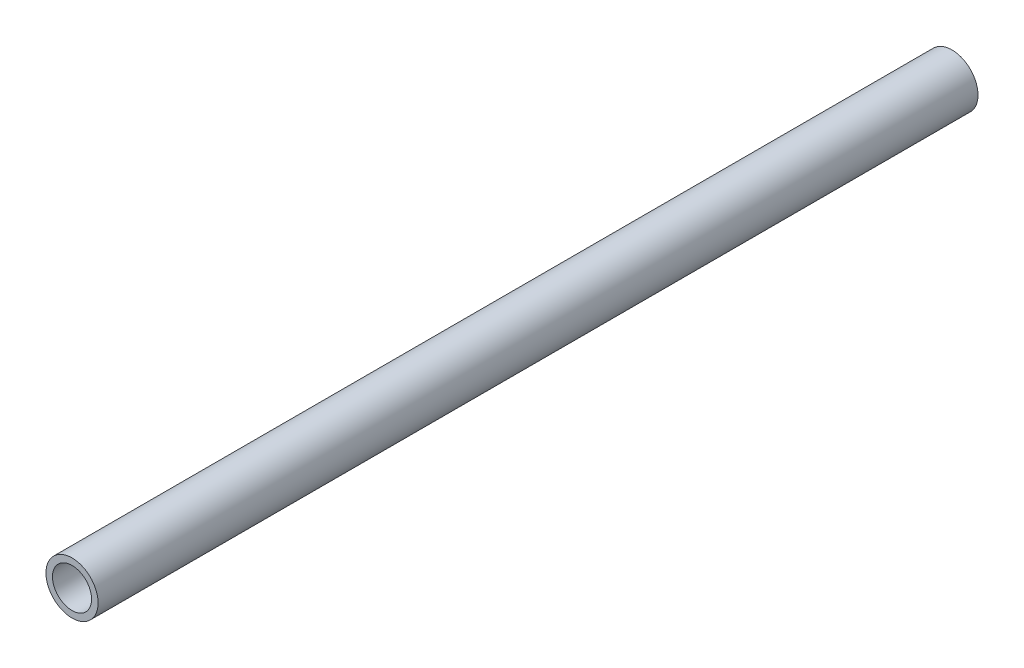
ISO-10303-21;
HEADER;
FILE_DESCRIPTION(('STEP AP214'),'2;1');
FILE_NAME('part.step','',(''),(''),'','','');
FILE_SCHEMA(('AUTOMOTIVE_DESIGN { 1 0 10303 214 1 1 1 1 }'));
ENDSEC;
DATA;
#1=APPLICATION_CONTEXT('core data for automotive mechanical design processes');
#2=APPLICATION_PROTOCOL_DEFINITION('international standard','automotive_design',2000,#1);
#3=PRODUCT_CONTEXT('',#1,'mechanical');
#4=PRODUCT('Part','Part','',(#3));
#5=PRODUCT_RELATED_PRODUCT_CATEGORY('part','',(#4));
#6=PRODUCT_DEFINITION_FORMATION('','',#4);
#7=PRODUCT_DEFINITION_CONTEXT('part definition',#1,'design');
#8=PRODUCT_DEFINITION('design','',#6,#7);
#9=PRODUCT_DEFINITION_SHAPE('','',#8);
#10=(LENGTH_UNIT() NAMED_UNIT(*) SI_UNIT(.MILLI.,.METRE.));
#11=(NAMED_UNIT(*) PLANE_ANGLE_UNIT() SI_UNIT($,.RADIAN.));
#12=(NAMED_UNIT(*) SI_UNIT($,.STERADIAN.) SOLID_ANGLE_UNIT());
#13=UNCERTAINTY_MEASURE_WITH_UNIT(LENGTH_MEASURE(1.E-05),#10,'distance_accuracy_value','');
#14=(GEOMETRIC_REPRESENTATION_CONTEXT(3) GLOBAL_UNCERTAINTY_ASSIGNED_CONTEXT((#13)) GLOBAL_UNIT_ASSIGNED_CONTEXT((#10,
#11,#12)) REPRESENTATION_CONTEXT('',''));
#15=CARTESIAN_POINT('',(0.,0.,0.));
#16=DIRECTION('',(0.,0.,1.));
#17=DIRECTION('',(1.,0.,0.));
#18=AXIS2_PLACEMENT_3D('',#15,#16,#17);
#19=CARTESIAN_POINT('',(0.,0.,-135.));
#20=DIRECTION('',(0.,0.,1.));
#21=DIRECTION('',(1.,0.,0.));
#22=AXIS2_PLACEMENT_3D('',#19,#20,#21);
#23=CYLINDRICAL_SURFACE('',#22,4.);
#24=CARTESIAN_POINT('',(0.,0.,-135.));
#25=DIRECTION('',(0.,0.,1.));
#26=DIRECTION('',(1.,0.,0.));
#27=AXIS2_PLACEMENT_3D('',#24,#25,#26);
#28=CIRCLE('',#27,4.);
#29=CARTESIAN_POINT('',(4.,0.,-135.));
#30=VERTEX_POINT('',#29);
#31=EDGE_CURVE('E10',#30,#30,#28,.T.);
#32=ORIENTED_EDGE('',*,*,#31,.T.);
#33=EDGE_LOOP('',(#32));
#34=FACE_BOUND('',#33,.T.);
#35=CARTESIAN_POINT('',(0.,0.,0.));
#36=DIRECTION('',(0.,0.,1.));
#37=DIRECTION('',(1.,0.,0.));
#38=AXIS2_PLACEMENT_3D('',#35,#36,#37);
#39=CIRCLE('',#38,4.);
#40=CARTESIAN_POINT('',(4.,0.,0.));
#41=VERTEX_POINT('',#40);
#42=EDGE_CURVE('E34',#41,#41,#39,.T.);
#43=ORIENTED_EDGE('',*,*,#42,.F.);
#44=EDGE_LOOP('',(#43));
#45=FACE_BOUND('',#44,.T.);
#46=ADVANCED_FACE('F28',(#34,#45),#23,.T.);
#47=CARTESIAN_POINT('',(0.,0.,-135.));
#48=DIRECTION('',(0.,0.,1.));
#49=DIRECTION('',(1.,0.,0.));
#50=AXIS2_PLACEMENT_3D('',#47,#48,#49);
#51=PLANE('',#50);
#52=CARTESIAN_POINT('',(0.,0.,-135.));
#53=DIRECTION('',(0.,0.,1.));
#54=DIRECTION('',(1.,0.,0.));
#55=AXIS2_PLACEMENT_3D('',#52,#53,#54);
#56=CIRCLE('',#55,3.);
#57=CARTESIAN_POINT('',(3.,0.,-135.));
#58=VERTEX_POINT('',#57);
#59=EDGE_CURVE('E38',#58,#58,#56,.T.);
#60=ORIENTED_EDGE('',*,*,#59,.T.);
#61=EDGE_LOOP('',(#60));
#62=FACE_BOUND('',#61,.T.);
#63=ORIENTED_EDGE('',*,*,#31,.F.);
#64=EDGE_LOOP('',(#63));
#65=FACE_BOUND('',#64,.T.);
#66=ADVANCED_FACE('F52',(#62,#65),#51,.F.);
#67=CARTESIAN_POINT('',(0.,0.,0.));
#68=DIRECTION('',(0.,0.,1.));
#69=DIRECTION('',(1.,0.,0.));
#70=AXIS2_PLACEMENT_3D('',#67,#68,#69);
#71=PLANE('',#70);
#72=CARTESIAN_POINT('',(0.,0.,0.));
#73=DIRECTION('',(0.,0.,1.));
#74=DIRECTION('',(1.,0.,0.));
#75=AXIS2_PLACEMENT_3D('',#72,#73,#74);
#76=CIRCLE('',#75,3.);
#77=CARTESIAN_POINT('',(3.,0.,0.));
#78=VERTEX_POINT('',#77);
#79=EDGE_CURVE('E42',#78,#78,#76,.T.);
#80=ORIENTED_EDGE('',*,*,#79,.F.);
#81=EDGE_LOOP('',(#80));
#82=FACE_BOUND('',#81,.T.);
#83=ORIENTED_EDGE('',*,*,#42,.T.);
#84=EDGE_LOOP('',(#83));
#85=FACE_BOUND('',#84,.T.);
#86=ADVANCED_FACE('F50',(#82,#85),#71,.T.);
#87=CARTESIAN_POINT('',(0.,0.,-135.));
#88=DIRECTION('',(0.,0.,1.));
#89=DIRECTION('',(1.,0.,0.));
#90=AXIS2_PLACEMENT_3D('',#87,#88,#89);
#91=CYLINDRICAL_SURFACE('',#90,3.);
#92=ORIENTED_EDGE('',*,*,#59,.F.);
#93=EDGE_LOOP('',(#92));
#94=FACE_BOUND('',#93,.T.);
#95=ORIENTED_EDGE('',*,*,#79,.T.);
#96=EDGE_LOOP('',(#95));
#97=FACE_BOUND('',#96,.T.);
#98=ADVANCED_FACE('F48',(#94,#97),#91,.F.);
#99=CLOSED_SHELL('',(#46,#66,#86,#98));
#100=MANIFOLD_SOLID_BREP('B2',#99);
#101=ADVANCED_BREP_SHAPE_REPRESENTATION('',(#18,#100),#14);
#102=SHAPE_DEFINITION_REPRESENTATION(#9,#101);
ENDSEC;
END-ISO-10303-21;
